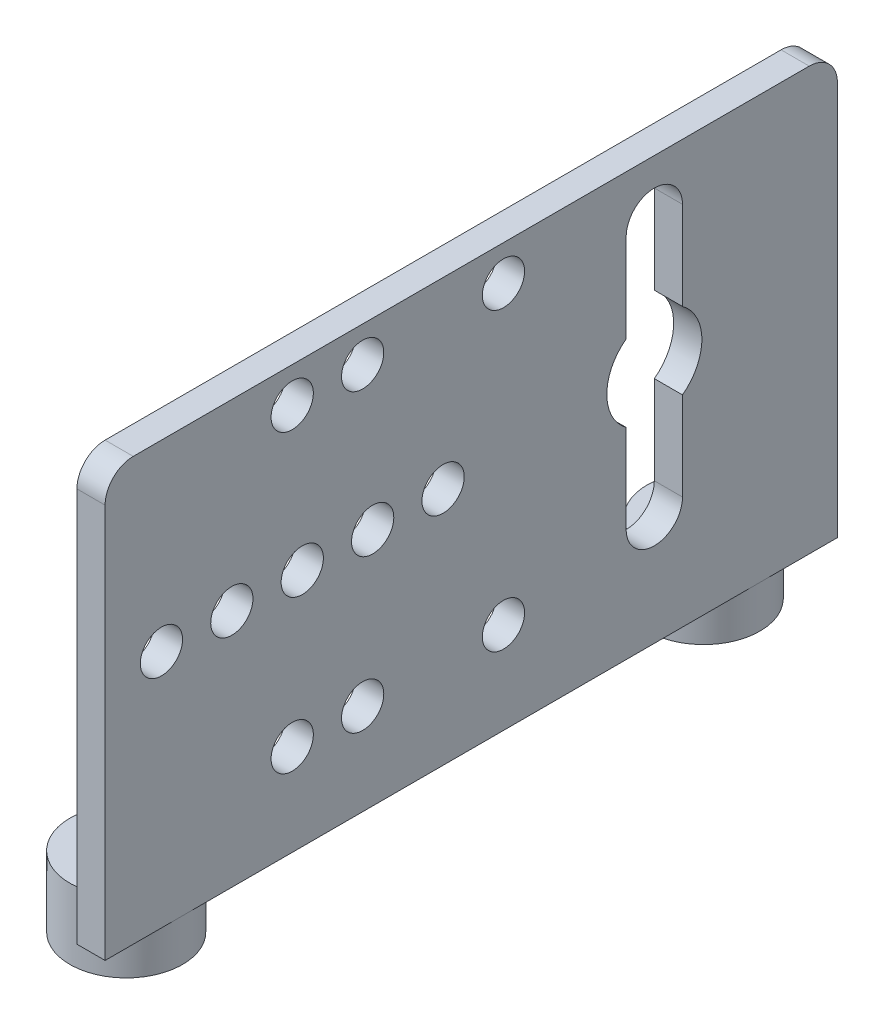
from build123d import *

# Parameters (mm, degrees)
SALIENTE_EXTRUIR1_DEPTH    = 52
CORTAR_EXTRUIR1_DEPTH      = 3
REDONDEO2_R                = 2
CROQUIS3_R                 = 1.5
CORTAR_EXTRUIR2_DEPTH      = 2
CORTAR_EXTRUIR3_DEPTH      = 62.22091146
CORTAR_EXTRUIR3_DEPTH_BACK = 62.22091146
CROQUIS5_W                 = 10
CROQUIS5_H                 = 3
SALIENTE_EXTRUIR2_START    = -2
CROQUIS6_R                 = 4
SALIENTE_EXTRUIR2_DEPTH    = 5
CROQUIS7_R                 = 3.25
CORTAR_EXTRUIR4_DEPTH      = 3
CORTAR_EXTRUIR5_DEPTH      = 61.332412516
CORTAR_EXTRUIR5_DEPTH_BACK = 61.332412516


with BuildPart() as part:
    # Croquis1 → Saliente-Extruir1 (new body)
    with BuildSketch(Plane.XY):
        Polygon((0, 0), (12, 0), (12, 3), (2, 3), (2, 30), (0, 30), align=None)
    extrude(amount=SALIENTE_EXTRUIR1_DEPTH)

    # Croquis2 → Cortar-Extruir1 (cut)
    with BuildSketch(Plane(origin=(0, 3, 0), x_dir=(1, 0, 0), z_dir=(0, 1, 0))):
        with BuildLine():
            Line((12, -4), (6.5, -4))
            ThreePointArc((6.5, -4), (5, -5.5), (6.5, -7))
            Line((6.5, -7), (12, -7))
            Line((12, -7), (12, -4))
        make_face()
        with BuildLine():
            Line((12, -29), (6.5, -29))
            ThreePointArc((6.5, -29), (5, -30.5), (6.5, -32))
            Line((6.5, -32), (12, -32))
            Line((12, -32), (12, -29))
        make_face()
        with BuildLine():
            Line((12, -44), (6.5, -44))
            ThreePointArc((6.5, -44), (5, -45.5), (6.5, -47))
            Line((6.5, -47), (12, -47))
            Line((12, -47), (12, -44))
        make_face()
    extrude(amount=-CORTAR_EXTRUIR1_DEPTH, mode=Mode.SUBTRACT)

    # Redondeo2
    redondeo2_edges = [part.edges().sort_by_distance(p)[0] for p in [
        (12, 1.5, 52),
        (1, 30, 52),
        (1, 30, 0),
        (12, 1.5, 0),
    ]]
    fillet(redondeo2_edges, radius=REDONDEO2_R)

    # Croquis3 → Cortar-Extruir2 (cut)
    with BuildSketch(Plane(origin=(2, 0, 0), x_dir=(0, 0, -1), z_dir=(1, 0, 0))):
        with Locations(Location((-43, 17, 0), (0, 0, 90))):
            Circle(CROQUIS3_R)
        with Locations(Location((-38, 17, 0), (0, 0, 90))):
            Circle(CROQUIS3_R)
        with Locations(Location((-48, 17, 0), (0, 0, 90))):
            Circle(CROQUIS3_R)
        with Locations(Location((-33, 17, 0), (0, 0, 90))):
            Circle(CROQUIS3_R)
        with Locations(Location((-28, 17, 0), (0, 0, 90))):
            Circle(CROQUIS3_R)
        with Locations(Location((-38.712142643, 27.5, 0), (0, 0, 90))):
            Circle(CROQUIS3_R)
        with Locations(Location((-33.712142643, 27.5, 0), (0, 0, 90))):
            Circle(CROQUIS3_R)
        with Locations(Location((-33.712142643, 6.5, 0), (0, 0, 90))):
            Circle(CROQUIS3_R)
        with Locations(Location((-38.712142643, 6.5, 0), (0, 0, 90))):
            Circle(CROQUIS3_R)
        with Locations(Location((-23.712142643, 6.5, 0), (0, 0, 90))):
            Circle(CROQUIS3_R)
        with Locations(Location((-23.712142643, 27.5, 0), (0, 0, 90))):
            Circle(CROQUIS3_R)
    extrude(amount=-CORTAR_EXTRUIR2_DEPTH, mode=Mode.SUBTRACT)

    # Croquis5 → Cortar-Extruir3 (cut, two sides: drawn at the far end of the back side and taken through both)
    with BuildSketch(Plane.XY.offset(52).offset(-CORTAR_EXTRUIR3_DEPTH_BACK)):
        with Locations((7, 1.5)):
            Rectangle(CROQUIS5_W, CROQUIS5_H)
    extrude(amount=CORTAR_EXTRUIR3_DEPTH + CORTAR_EXTRUIR3_DEPTH_BACK, mode=Mode.SUBTRACT)

    # Croquis6 → Saliente-Extruir2 (add)
    with BuildSketch(Plane.XZ.offset(SALIENTE_EXTRUIR2_START)):
        with Locations(Location((-2, 46.5, 0), (0, 0, 60))):
            Circle(CROQUIS6_R)
    saliente_extruir2 = extrude(amount=SALIENTE_EXTRUIR2_DEPTH)

    # Croquis7 → Cortar-Extruir4 (cut)
    with BuildSketch(Plane.XZ.offset(3)):
        with Locations(Location((-2, 46.5, 0), (0, 0, 270))):
            Circle(CROQUIS7_R)
    cortar_extruir4 = extrude(amount=-CORTAR_EXTRUIR4_DEPTH, mode=Mode.SUBTRACT)

    # Simetr_a1: Saliente-Extruir2, Cortar-Extruir4 across plane
    add(saliente_extruir2.mirror(Plane.XY.offset(26)))
    add(cortar_extruir4.mirror(Plane.XY.offset(26)), mode=Mode.SUBTRACT)

    # Croquis8 → Cortar-Extruir5 (cut, two sides: drawn at the far end of the back side and taken through both)
    with BuildSketch(Plane.ZY.offset(-CORTAR_EXTRUIR5_DEPTH_BACK)):
        with BuildLine():
            Line((11, 26), (11, 19.718570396))
            ThreePointArc((11, 19.718570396), (9.625, 17), (11, 14.281429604))
            Line((11, 14.281429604), (11, 8))
            ThreePointArc((11, 8), (13, 6), (15, 8))
            Line((15, 8), (15, 14.281429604))
            ThreePointArc((15, 14.281429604), (16.375, 17), (15, 19.718570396))
            Line((15, 19.718570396), (15, 26))
            ThreePointArc((15, 26), (13, 28), (11, 26))
        make_face()
    extrude(amount=CORTAR_EXTRUIR5_DEPTH + CORTAR_EXTRUIR5_DEPTH_BACK, mode=Mode.SUBTRACT)


solid = part.part
